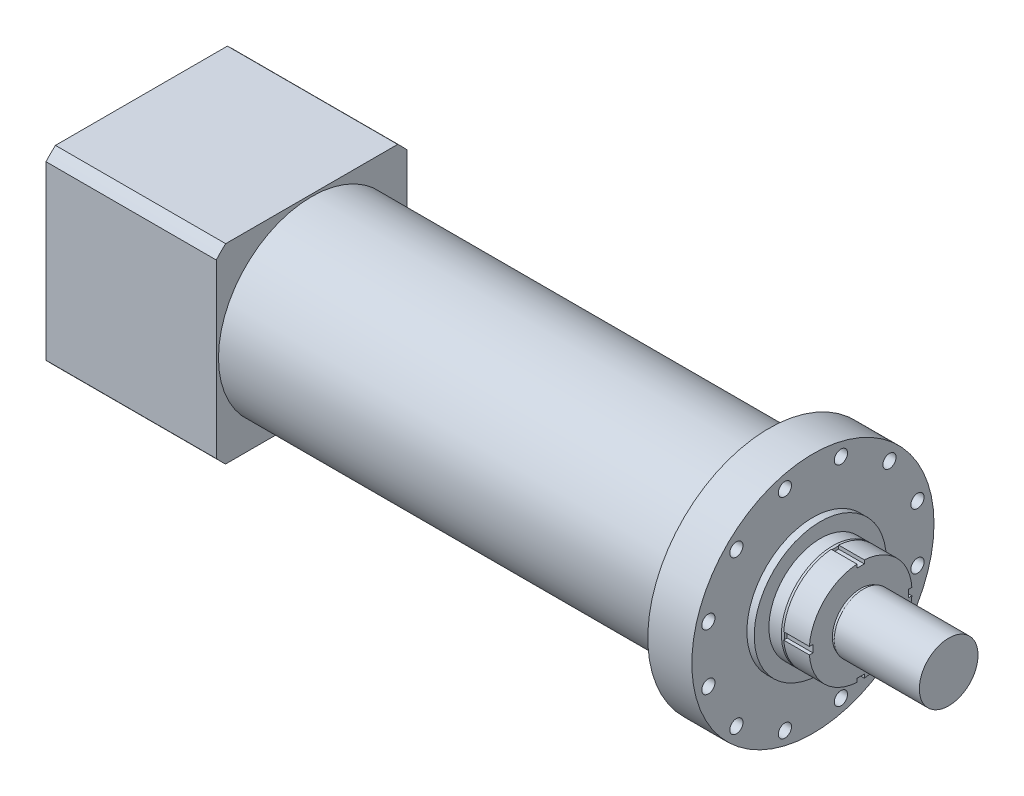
from build123d import *

# Parameters (mm, degrees)
SKETCH_1_R          = 127
SKETCH_1_R_2        = 110
EXTRUDE_1_DEPTH     = 623
SKETCH_2_R          = 165
EXTRUDE_2_DEPTH     = 60
SKETCH_3_R          = 90
EXTRUDE_3_DEPTH     = 10
SKETCH_4_R          = 9
CUT_EXTRUDE_1_DEPTH = 60
SKETCH_5_R          = 70
EXTRUDE_4_DEPTH     = 20
CHAMFER_1_SIZE      = 3
CHAMFER_1_SIZE2     = 1.091910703
SKETCH_7_R          = 70
EXTRUDE_5_DEPTH     = 35
SKETCH_8_R          = 38.5
EXTRUDE_6_DEPTH     = 4
SKETCH_9_R          = 40
EXTRUDE_7_DEPTH     = 116
SKETCH_10_W         = 10
SKETCH_10_H         = 12.219318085
SKETCH_10_W_2       = 33.965202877
SKETCH_10_H_2       = 10
SKETCH_10_H_3       = 35.687535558
CUT_EXTRUDE_2_DEPTH = 35
SKETCH_11_R         = 130
EXTRUDE_8_DEPTH     = 162
EXTRUDE_10_DEPTH    = 70
SKETCH_16_R         = 80
CUT_EXTRUDE_4_DEPTH = 26
SKETCH_17_R         = 81.5
CUT_EXTRUDE_5_DEPTH = 38
EXTRUDE_11_DEPTH    = 162


with BuildPart() as part:
    # Sketch 1 → Extrude 1 (new body)
    with BuildSketch(Plane(origin=(0, 0, 0), x_dir=(0, 0, -1), z_dir=(1, 0, 0))):
        Circle(SKETCH_1_R)
        Circle(SKETCH_1_R_2, mode=Mode.SUBTRACT)
    extrude(amount=EXTRUDE_1_DEPTH)



with BuildPart() as body_2:
    # Sketch 2 → Extrude 2 (new body)
    with BuildSketch(Plane(origin=(623, 0, 0), x_dir=(0, 0, -1), z_dir=(1, 0, 0))):
        Circle(SKETCH_2_R)
    extrude(amount=EXTRUDE_2_DEPTH)

    # Sketch 3 → Extrude 3 (add)
    with BuildSketch(Plane(origin=(683, 0, 0), x_dir=(0, 0, -1), z_dir=(1, 0, 0))):
        Circle(SKETCH_3_R)
    extrude(amount=EXTRUDE_3_DEPTH)

    # Sketch 4 → Cut-Extrude 1 (cut)
    with BuildSketch(Plane(origin=(683, 0, 0), x_dir=(0, 0, -1), z_dir=(1, 0, 0))):
        with Locations((38.175809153, 142.474059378)):
            Circle(SKETCH_4_R)
        with Locations((104.298250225, 104.298250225)):
            Circle(SKETCH_4_R)
        with Locations((142.474059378, 38.175809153)):
            Circle(SKETCH_4_R)
        with Locations((142.474059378, -38.175809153)):
            Circle(SKETCH_4_R)
        with Locations((104.298250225, -104.298250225)):
            Circle(SKETCH_4_R)
        with Locations((38.175809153, -142.474059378)):
            Circle(SKETCH_4_R)
        with Locations((-38.175809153, -142.474059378)):
            Circle(SKETCH_4_R)
        with Locations((-104.298250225, -104.298250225)):
            Circle(SKETCH_4_R)
        with Locations((-142.474059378, -38.175809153)):
            Circle(SKETCH_4_R)
        with Locations((-142.474059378, 38.175809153)):
            Circle(SKETCH_4_R)
        with Locations((-104.298250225, 104.298250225)):
            Circle(SKETCH_4_R)
        with Locations((-38.175809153, 142.474059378)):
            Circle(SKETCH_4_R)
    extrude(amount=-CUT_EXTRUDE_1_DEPTH, mode=Mode.SUBTRACT)

    # Sketch 5 → Extrude 4 (add)
    with BuildSketch(Plane(origin=(693, 0, 0), x_dir=(0, 0, -1), z_dir=(1, 0, 0))):
        Circle(SKETCH_5_R)
    extrude(amount=EXTRUDE_4_DEPTH)

    # Chamfer 1
    chamfer_1_edges = [body_2.edges().sort_by_distance(p)[0] for p in [
        (713, 0, 70),
    ]]
    chamfer_1_side = [body_2.faces().sort_by_distance(p)[0] for p in [
        (703, 0, 70),
    ]]
    chamfer(chamfer_1_edges, length=CHAMFER_1_SIZE, length2=CHAMFER_1_SIZE2, reference=chamfer_1_side[0])

    # Sketch 7 → Extrude 5 (add)
    with BuildSketch(Plane(origin=(713, 0, 0), x_dir=(0, 0, -1), z_dir=(1, 0, 0))):
        Circle(SKETCH_7_R)
    extrude(amount=EXTRUDE_5_DEPTH)

    # Sketch 8 → Extrude 6 (add)
    with BuildSketch(Plane(origin=(748, 0, 0), x_dir=(0, 0, -1), z_dir=(1, 0, 0))):
        Circle(SKETCH_8_R)
    extrude(amount=EXTRUDE_6_DEPTH)

    # Sketch 9 → Extrude 7 (add)
    with BuildSketch(Plane(origin=(752, 0, 0), x_dir=(0, 0, -1), z_dir=(1, 0, 0))):
        with Locations(Location((0, 0, 0), (0, 0, 180))):
            Circle(SKETCH_9_R)
    extrude(amount=EXTRUDE_7_DEPTH)

    # Sketch 10 → Cut-Extrude 2 (cut)
    with BuildSketch(Plane(origin=(748, 0, 0), x_dir=(0, 0, -1), z_dir=(1, 0, 0))):
        with Locations((0, -71.109659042)):
            Rectangle(SKETCH_10_W, SKETCH_10_H)
        Polygon((-76.465931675, 5), (-65, 5), (-65, -5), (-79.460488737, -5), align=None)
        with Locations((81.982601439, 0)):
            Rectangle(SKETCH_10_W_2, SKETCH_10_H_2)
        with Locations((0, 82.843767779)):
            Rectangle(SKETCH_10_W, SKETCH_10_H_3)
    extrude(amount=-CUT_EXTRUDE_2_DEPTH, mode=Mode.SUBTRACT)


with BuildPart() as body_3:
    # Sketch 11 → Extrude 8 (new body)
    with BuildSketch(Plane.ZY):
        Circle(SKETCH_11_R)
    extrude(amount=EXTRUDE_8_DEPTH)


with BuildPart() as body_4:
    # Sketch 15 → Extrude 10 (new body)
    with BuildSketch(Plane.ZY.offset(162)):
        with BuildLine():
            Line((-117.153745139, 130), (117.153745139, 130))
            ThreePointArc((117.153745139, 130), (123.743686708, 123.743686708), (130, 117.153745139))
            Line((130, 117.153745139), (130, -117.153745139))
            ThreePointArc((130, -117.153745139), (123.743686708, -123.743686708), (117.153745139, -130))
            Line((117.153745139, -130), (-117.153745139, -130))
            ThreePointArc((-117.153745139, -130), (-123.743686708, -123.743686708), (-130, -117.153745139))
            Line((-130, -117.153745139), (-130, 117.153745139))
            ThreePointArc((-130, 117.153745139), (-123.743686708, 123.743686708), (-117.153745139, 130))
        make_face()
    extrude(amount=EXTRUDE_10_DEPTH)

    # Sketch 16 → Cut-Extrude 4 (cut)
    with BuildSketch(Plane.ZY.offset(232)):
        Circle(SKETCH_16_R)
    extrude(amount=-CUT_EXTRUDE_4_DEPTH, mode=Mode.SUBTRACT)

    # Sketch 17 → Cut-Extrude 5 (cut)
    with BuildSketch(Plane.ZY.offset(206)):
        Circle(SKETCH_17_R)
    extrude(amount=-CUT_EXTRUDE_5_DEPTH, mode=Mode.SUBTRACT)


with BuildPart() as part_1:
    add(part.part)

    add(body_3.part)  # Extrude 11 merges body 3

    add(body_4.part)  # Extrude 11 merges body 4
    # Sketch 18 → Extrude 11 (add)
    with BuildSketch(Plane(origin=(-162, 0, 0), x_dir=(0, 0, -1), z_dir=(1, 0, 0))):
        with BuildLine():
            Line((130, 117.153745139), (130, -117.153745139))
            ThreePointArc((130, -117.153745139), (123.743686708, -123.743686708), (117.153745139, -130))
            Line((117.153745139, -130), (-117.153745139, -130))
            ThreePointArc((-117.153745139, -130), (-123.743686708, -123.743686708), (-130, -117.153745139))
            Line((-130, -117.153745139), (-130, 117.153745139))
            ThreePointArc((-130, 117.153745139), (-123.743686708, 123.743686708), (-117.153745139, 130))
            Line((-117.153745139, 130), (117.153745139, 130))
            ThreePointArc((117.153745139, 130), (123.743686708, 123.743686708), (130, 117.153745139))
        make_face()
    extrude(amount=EXTRUDE_11_DEPTH)


solid = Compound([body_2.part, part_1.part])
